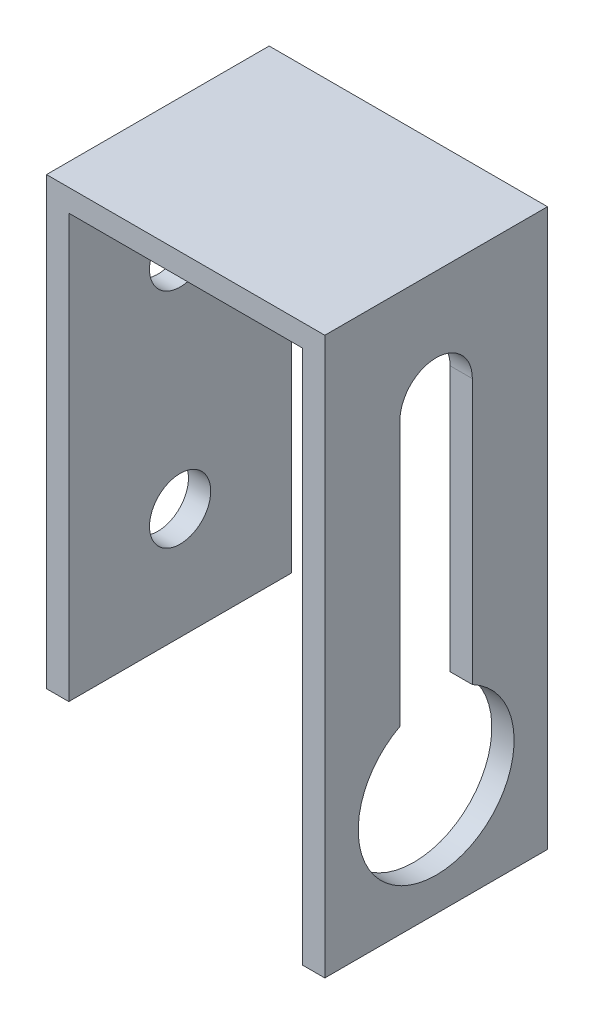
from build123d import *

# Parameters (mm, degrees)
EXTRUDE_1_DEPTH     = 20
CUT_EXTRUDE_1_DEPTH = 2
CUT_EXTRUDE_2_REACH = 53.235
SKETCH_3_R          = 7
CUT_EXTRUDE_3_REACH = 52.289
SKETCH_4_R          = 2.75


with BuildPart() as part:
    # Sketch 1 → Extrude 1 (new body)
    with BuildSketch(Plane.XY):
        Polygon((0, 0), (0, 40), (25, 40), (25, -10), (23, -10), (23, 38), (2, 38), (2, 0), align=None)
    extrude(amount=EXTRUDE_1_DEPTH)

    # Sketch 2 → Cut-Extrude 1 (cut)
    with BuildSketch(Plane(origin=(25, 0, 0), x_dir=(0, 0, -1), z_dir=(1, 0, 0))):
        with BuildLine():
            Line((-6.75, 30), (-6.75, 0))
            ThreePointArc((-6.75, 0), (-10, -3.25), (-13.25, 0))
            Line((-13.25, 0), (-13.25, 30))
            ThreePointArc((-13.25, 30), (-10, 33.25), (-6.75, 30))
        make_face()
    extrude(amount=-CUT_EXTRUDE_1_DEPTH, mode=Mode.SUBTRACT)

    # Sketch 3 → Cut-Extrude 2 (cut, up to next)
    with BuildSketch(Plane(origin=(25, 0, 0), x_dir=(0, 0, -1), z_dir=(1, 0, 0)), mode=Mode.PRIVATE) as cut_extrude_2_sk1:
        with Locations((-10, 0)):
            Circle(SKETCH_3_R)
    cut_extrude_2_tool1 = extrude(cut_extrude_2_sk1.sketch, amount=-CUT_EXTRUDE_2_REACH, mode=Mode.PRIVATE) & part.part
    add(cut_extrude_2_tool1.solids().sort_by_distance((25, 0, 10))[0], mode=Mode.SUBTRACT)

    # Sketch 4 → Cut-Extrude 3 (cut, up to next)
    with BuildSketch(Plane(origin=(2, 0, 0), x_dir=(0, 0, -1), z_dir=(1, 0, 0)), mode=Mode.PRIVATE) as cut_extrude_3_sk1:
        with Locations((-10, 30)):
            Circle(SKETCH_4_R)
    cut_extrude_3_tool1 = extrude(cut_extrude_3_sk1.sketch, amount=-CUT_EXTRUDE_3_REACH, mode=Mode.PRIVATE) & part.part
    # Sketch 4 → Cut-Extrude 3 (cut, up to next)
    with BuildSketch(Plane(origin=(2, 0, 0), x_dir=(0, 0, -1), z_dir=(1, 0, 0)), mode=Mode.PRIVATE) as cut_extrude_3_sk2:
        with Locations((-10, 10)):
            Circle(SKETCH_4_R)
    cut_extrude_3_tool2 = extrude(cut_extrude_3_sk2.sketch, amount=-CUT_EXTRUDE_3_REACH, mode=Mode.PRIVATE) & part.part
    add(cut_extrude_3_tool1.solids().sort_by_distance((2, 30, 10))[0], mode=Mode.SUBTRACT)
    add(cut_extrude_3_tool2.solids().sort_by_distance((2, 10, 10))[0], mode=Mode.SUBTRACT)


solid = part.part
